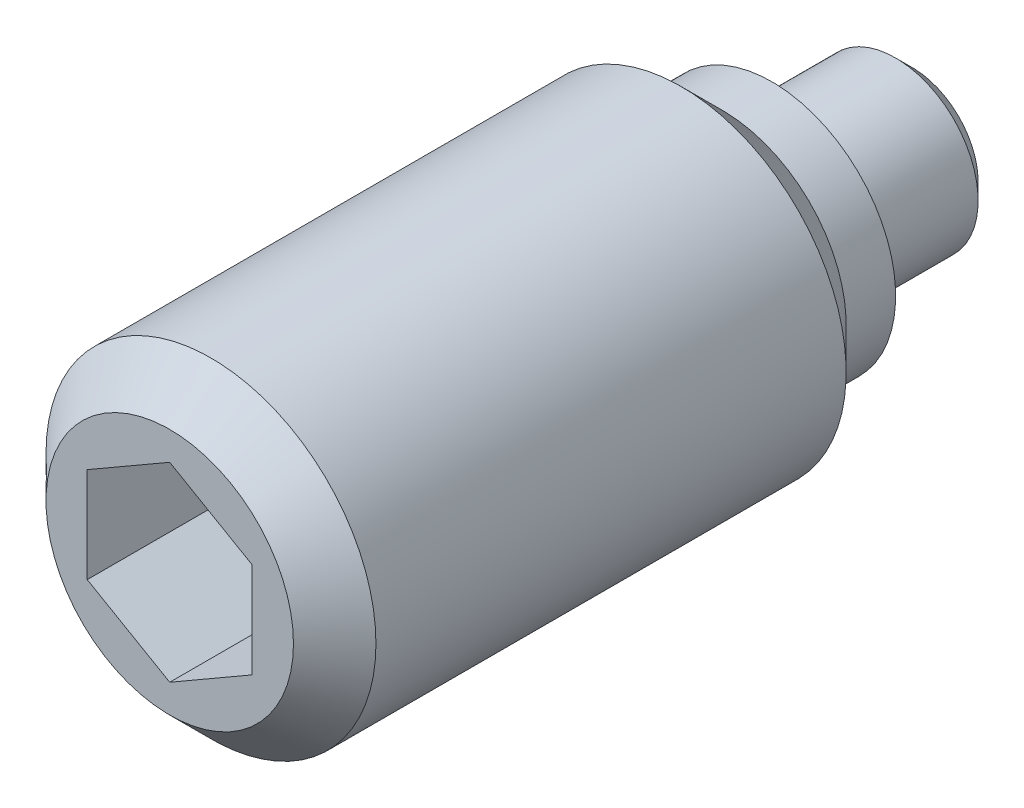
ISO-10303-21;
HEADER;
FILE_DESCRIPTION(('STEP AP214'),'2;1');
FILE_NAME('part.step','',(''),(''),'','','');
FILE_SCHEMA(('AUTOMOTIVE_DESIGN { 1 0 10303 214 1 1 1 1 }'));
ENDSEC;
DATA;
#1=APPLICATION_CONTEXT('core data for automotive mechanical design processes');
#2=APPLICATION_PROTOCOL_DEFINITION('international standard','automotive_design',2000,#1);
#3=PRODUCT_CONTEXT('',#1,'mechanical');
#4=PRODUCT('Part','Part','',(#3));
#5=PRODUCT_RELATED_PRODUCT_CATEGORY('part','',(#4));
#6=PRODUCT_DEFINITION_FORMATION('','',#4);
#7=PRODUCT_DEFINITION_CONTEXT('part definition',#1,'design');
#8=PRODUCT_DEFINITION('design','',#6,#7);
#9=PRODUCT_DEFINITION_SHAPE('','',#8);
#10=(LENGTH_UNIT() NAMED_UNIT(*) SI_UNIT(.MILLI.,.METRE.));
#11=(NAMED_UNIT(*) PLANE_ANGLE_UNIT() SI_UNIT($,.RADIAN.));
#12=(NAMED_UNIT(*) SI_UNIT($,.STERADIAN.) SOLID_ANGLE_UNIT());
#13=UNCERTAINTY_MEASURE_WITH_UNIT(LENGTH_MEASURE(1.E-05),#10,'distance_accuracy_value','');
#14=(GEOMETRIC_REPRESENTATION_CONTEXT(3) GLOBAL_UNCERTAINTY_ASSIGNED_CONTEXT((#13)) GLOBAL_UNIT_ASSIGNED_CONTEXT((#10,
#11,#12)) REPRESENTATION_CONTEXT('',''));
#15=CARTESIAN_POINT('',(0.,0.,0.));
#16=DIRECTION('',(0.,0.,1.));
#17=DIRECTION('',(1.,0.,0.));
#18=AXIS2_PLACEMENT_3D('',#15,#16,#17);
#19=CARTESIAN_POINT('',(0.,0.,0.));
#20=DIRECTION('',(0.,0.,-1.));
#21=DIRECTION('',(-1.,0.,0.));
#22=AXIS2_PLACEMENT_3D('',#19,#20,#21);
#23=CYLINDRICAL_SURFACE('',#22,1.);
#24=CARTESIAN_POINT('',(0.,0.,0.2));
#25=DIRECTION('',(0.,0.,-1.));
#26=DIRECTION('',(-1.,0.,0.));
#27=AXIS2_PLACEMENT_3D('',#24,#25,#26);
#28=CIRCLE('',#27,1.);
#29=CARTESIAN_POINT('',(-1.,0.,0.2));
#30=VERTEX_POINT('',#29);
#31=EDGE_CURVE('E133',#30,#30,#28,.T.);
#32=ORIENTED_EDGE('',*,*,#31,.F.);
#33=EDGE_LOOP('',(#32));
#34=FACE_BOUND('',#33,.T.);
#35=CARTESIAN_POINT('',(0.,0.,1.7));
#36=DIRECTION('',(0.,0.,-1.));
#37=DIRECTION('',(-1.,0.,0.));
#38=AXIS2_PLACEMENT_3D('',#35,#36,#37);
#39=CIRCLE('',#38,1.);
#40=CARTESIAN_POINT('',(-1.,0.,1.7));
#41=VERTEX_POINT('',#40);
#42=EDGE_CURVE('E127',#41,#41,#39,.T.);
#43=ORIENTED_EDGE('',*,*,#42,.T.);
#44=EDGE_LOOP('',(#43));
#45=FACE_BOUND('',#44,.T.);
#46=ADVANCED_FACE('F14',(#34,#45),#23,.T.);
#47=CARTESIAN_POINT('',(0.,0.,0.2));
#48=DIRECTION('',(0.,0.,1.));
#49=DIRECTION('',(1.,0.,0.));
#50=AXIS2_PLACEMENT_3D('',#47,#48,#49);
#51=CONICAL_SURFACE('',#50,1.,0.785398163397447);
#52=CARTESIAN_POINT('',(0.,0.,0.));
#53=DIRECTION('',(0.,0.,-1.));
#54=DIRECTION('',(-1.,0.,0.));
#55=AXIS2_PLACEMENT_3D('',#52,#53,#54);
#56=CIRCLE('',#55,0.8);
#57=CARTESIAN_POINT('',(-0.8,0.,0.));
#58=VERTEX_POINT('',#57);
#59=EDGE_CURVE('E130',#58,#58,#56,.T.);
#60=ORIENTED_EDGE('',*,*,#59,.F.);
#61=EDGE_LOOP('',(#60));
#62=FACE_BOUND('',#61,.T.);
#63=ORIENTED_EDGE('',*,*,#31,.T.);
#64=EDGE_LOOP('',(#63));
#65=FACE_BOUND('',#64,.T.);
#66=ADVANCED_FACE('F157',(#62,#65),#51,.T.);
#67=CARTESIAN_POINT('',(0.,0.8,0.));
#68=DIRECTION('',(0.,0.,1.));
#69=DIRECTION('',(1.,0.,0.));
#70=AXIS2_PLACEMENT_3D('',#67,#68,#69);
#71=PLANE('',#70);
#72=ORIENTED_EDGE('',*,*,#59,.T.);
#73=EDGE_LOOP('',(#72));
#74=FACE_BOUND('',#73,.T.);
#75=ADVANCED_FACE('F154',(#74),#71,.F.);
#76=CARTESIAN_POINT('',(0.,0.,1.7));
#77=DIRECTION('',(0.,0.,-1.));
#78=DIRECTION('',(-1.,0.,0.));
#79=AXIS2_PLACEMENT_3D('',#76,#77,#78);
#80=CYLINDRICAL_SURFACE('',#79,2.);
#81=CARTESIAN_POINT('',(0.,0.,2.8));
#82=DIRECTION('',(0.,0.,-1.));
#83=DIRECTION('',(-1.,0.,0.));
#84=AXIS2_PLACEMENT_3D('',#81,#82,#83);
#85=CIRCLE('',#84,2.);
#86=CARTESIAN_POINT('',(-2.,0.,2.8));
#87=VERTEX_POINT('',#86);
#88=EDGE_CURVE('E9',#87,#87,#85,.T.);
#89=ORIENTED_EDGE('',*,*,#88,.F.);
#90=EDGE_LOOP('',(#89));
#91=FACE_BOUND('',#90,.T.);
#92=CARTESIAN_POINT('',(0.,0.,8.5));
#93=DIRECTION('',(0.,0.,1.));
#94=DIRECTION('',(1.,0.,0.));
#95=AXIS2_PLACEMENT_3D('',#92,#93,#94);
#96=CIRCLE('',#95,2.);
#97=CARTESIAN_POINT('',(2.,0.,8.5));
#98=VERTEX_POINT('',#97);
#99=EDGE_CURVE('E124',#98,#98,#96,.T.);
#100=ORIENTED_EDGE('',*,*,#99,.F.);
#101=EDGE_LOOP('',(#100));
#102=FACE_BOUND('',#101,.T.);
#103=ADVANCED_FACE('F16',(#91,#102),#80,.T.);
#104=CARTESIAN_POINT('',(0.,0.,2.8));
#105=DIRECTION('',(0.,0.,1.));
#106=DIRECTION('',(1.,0.,0.));
#107=AXIS2_PLACEMENT_3D('',#104,#105,#106);
#108=CONICAL_SURFACE('',#107,2.,0.785398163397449);
#109=ORIENTED_EDGE('',*,*,#88,.T.);
#110=EDGE_LOOP('',(#109));
#111=FACE_BOUND('',#110,.T.);
#112=CARTESIAN_POINT('',(0.,0.,2.3));
#113=DIRECTION('',(0.,0.,-1.));
#114=DIRECTION('',(-1.,0.,0.));
#115=AXIS2_PLACEMENT_3D('',#112,#113,#114);
#116=CIRCLE('',#115,1.5);
#117=CARTESIAN_POINT('',(-1.5,0.,2.3));
#118=VERTEX_POINT('',#117);
#119=EDGE_CURVE('E22',#118,#118,#116,.T.);
#120=ORIENTED_EDGE('',*,*,#119,.F.);
#121=EDGE_LOOP('',(#120));
#122=FACE_BOUND('',#121,.T.);
#123=ADVANCED_FACE('F143',(#111,#122),#108,.T.);
#124=CARTESIAN_POINT('',(0.,0.,1.7));
#125=DIRECTION('',(0.,0.,-1.));
#126=DIRECTION('',(-1.,0.,0.));
#127=AXIS2_PLACEMENT_3D('',#124,#125,#126);
#128=CYLINDRICAL_SURFACE('',#127,1.5);
#129=CARTESIAN_POINT('',(0.,0.,1.7));
#130=DIRECTION('',(0.,0.,-1.));
#131=DIRECTION('',(-1.,0.,0.));
#132=AXIS2_PLACEMENT_3D('',#129,#130,#131);
#133=CIRCLE('',#132,1.5);
#134=CARTESIAN_POINT('',(-1.5,0.,1.7));
#135=VERTEX_POINT('',#134);
#136=EDGE_CURVE('E136',#135,#135,#133,.T.);
#137=ORIENTED_EDGE('',*,*,#136,.F.);
#138=EDGE_LOOP('',(#137));
#139=FACE_BOUND('',#138,.T.);
#140=ORIENTED_EDGE('',*,*,#119,.T.);
#141=EDGE_LOOP('',(#140));
#142=FACE_BOUND('',#141,.T.);
#143=ADVANCED_FACE('F141',(#139,#142),#128,.T.);
#144=CARTESIAN_POINT('',(0.,1.5,1.7));
#145=DIRECTION('',(0.,0.,1.));
#146=DIRECTION('',(1.,0.,0.));
#147=AXIS2_PLACEMENT_3D('',#144,#145,#146);
#148=PLANE('',#147);
#149=ORIENTED_EDGE('',*,*,#136,.T.);
#150=EDGE_LOOP('',(#149));
#151=FACE_BOUND('',#150,.T.);
#152=ORIENTED_EDGE('',*,*,#42,.F.);
#153=EDGE_LOOP('',(#152));
#154=FACE_BOUND('',#153,.T.);
#155=ADVANCED_FACE('F151',(#151,#154),#148,.F.);
#156=CARTESIAN_POINT('',(0.,-1.5,9.));
#157=DIRECTION('',(0.,0.,1.));
#158=DIRECTION('',(1.,0.,0.));
#159=AXIS2_PLACEMENT_3D('',#156,#157,#158);
#160=PLANE('',#159);
#161=DIRECTION('',(0.866025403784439,-0.5,0.));
#162=VECTOR('',#161,1.);
#163=CARTESIAN_POINT('',(-1.,-0.577350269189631,9.));
#164=LINE('',#163,#162);
#165=CARTESIAN_POINT('',(-1.,-0.577350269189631,9.));
#166=VERTEX_POINT('',#165);
#167=CARTESIAN_POINT('',(0.,-1.15470053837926,9.));
#168=VERTEX_POINT('',#167);
#169=EDGE_CURVE('E29',#166,#168,#164,.T.);
#170=ORIENTED_EDGE('',*,*,#169,.F.);
#171=DIRECTION('',(0.,-1.,0.));
#172=VECTOR('',#171,1.);
#173=CARTESIAN_POINT('',(-1.,0.577350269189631,9.));
#174=LINE('',#173,#172);
#175=CARTESIAN_POINT('',(-1.,0.577350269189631,9.));
#176=VERTEX_POINT('',#175);
#177=EDGE_CURVE('E112',#176,#166,#174,.T.);
#178=ORIENTED_EDGE('',*,*,#177,.F.);
#179=DIRECTION('',(-0.866025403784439,-0.5,0.));
#180=VECTOR('',#179,1.);
#181=CARTESIAN_POINT('',(0.,1.15470053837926,9.));
#182=LINE('',#181,#180);
#183=CARTESIAN_POINT('',(0.,1.15470053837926,9.));
#184=VERTEX_POINT('',#183);
#185=EDGE_CURVE('E110',#184,#176,#182,.T.);
#186=ORIENTED_EDGE('',*,*,#185,.F.);
#187=DIRECTION('',(-0.866025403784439,0.5,0.));
#188=VECTOR('',#187,1.);
#189=CARTESIAN_POINT('',(1.,0.577350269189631,9.));
#190=LINE('',#189,#188);
#191=CARTESIAN_POINT('',(1.,0.577350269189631,9.));
#192=VERTEX_POINT('',#191);
#193=EDGE_CURVE('E77',#192,#184,#190,.T.);
#194=ORIENTED_EDGE('',*,*,#193,.F.);
#195=DIRECTION('',(0.,1.,0.));
#196=VECTOR('',#195,1.);
#197=CARTESIAN_POINT('',(1.,-0.577350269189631,9.));
#198=LINE('',#197,#196);
#199=CARTESIAN_POINT('',(1.,-0.577350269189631,9.));
#200=VERTEX_POINT('',#199);
#201=EDGE_CURVE('E106',#200,#192,#198,.T.);
#202=ORIENTED_EDGE('',*,*,#201,.F.);
#203=DIRECTION('',(0.866025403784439,0.5,0.));
#204=VECTOR('',#203,1.);
#205=CARTESIAN_POINT('',(0.,-1.15470053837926,9.));
#206=LINE('',#205,#204);
#207=EDGE_CURVE('E103',#168,#200,#206,.T.);
#208=ORIENTED_EDGE('',*,*,#207,.F.);
#209=EDGE_LOOP('',(#170,#178,#186,#194,#202,#208));
#210=FACE_BOUND('',#209,.T.);
#211=CARTESIAN_POINT('',(0.,0.,9.));
#212=DIRECTION('',(0.,0.,1.));
#213=DIRECTION('',(1.,0.,0.));
#214=AXIS2_PLACEMENT_3D('',#211,#212,#213);
#215=CIRCLE('',#214,1.5);
#216=CARTESIAN_POINT('',(1.5,0.,9.));
#217=VERTEX_POINT('',#216);
#218=EDGE_CURVE('E116',#217,#217,#215,.T.);
#219=ORIENTED_EDGE('',*,*,#218,.T.);
#220=EDGE_LOOP('',(#219));
#221=FACE_BOUND('',#220,.T.);
#222=ADVANCED_FACE('F170',(#210,#221),#160,.T.);
#223=CARTESIAN_POINT('',(0.,0.,9.));
#224=DIRECTION('',(0.,0.,-1.));
#225=DIRECTION('',(-1.,0.,0.));
#226=AXIS2_PLACEMENT_3D('',#223,#224,#225);
#227=CONICAL_SURFACE('',#226,1.5,0.785398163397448);
#228=ORIENTED_EDGE('',*,*,#99,.T.);
#229=EDGE_LOOP('',(#228));
#230=FACE_BOUND('',#229,.T.);
#231=ORIENTED_EDGE('',*,*,#218,.F.);
#232=EDGE_LOOP('',(#231));
#233=FACE_BOUND('',#232,.T.);
#234=ADVANCED_FACE('F175',(#230,#233),#227,.T.);
#235=CARTESIAN_POINT('',(-1.,-0.577350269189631,6.5));
#236=DIRECTION('',(-0.5,-0.866025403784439,0.));
#237=DIRECTION('',(0.866025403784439,-0.5,0.));
#238=AXIS2_PLACEMENT_3D('',#235,#236,#237);
#239=PLANE('',#238);
#240=ORIENTED_EDGE('',*,*,#169,.T.);
#241=DIRECTION('',(0.,0.,1.));
#242=VECTOR('',#241,1.);
#243=CARTESIAN_POINT('',(0.,-1.15470053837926,6.5));
#244=LINE('',#243,#242);
#245=CARTESIAN_POINT('',(0.,-1.15470053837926,6.5));
#246=VERTEX_POINT('',#245);
#247=EDGE_CURVE('E59',#246,#168,#244,.T.);
#248=ORIENTED_EDGE('',*,*,#247,.F.);
#249=DIRECTION('',(0.866025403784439,-0.5,0.));
#250=VECTOR('',#249,1.);
#251=CARTESIAN_POINT('',(-1.,-0.577350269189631,6.5));
#252=LINE('',#251,#250);
#253=CARTESIAN_POINT('',(-1.,-0.577350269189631,6.5));
#254=VERTEX_POINT('',#253);
#255=EDGE_CURVE('E114',#254,#246,#252,.T.);
#256=ORIENTED_EDGE('',*,*,#255,.F.);
#257=DIRECTION('',(0.,0.,1.));
#258=VECTOR('',#257,1.);
#259=CARTESIAN_POINT('',(-1.,-0.577350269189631,6.5));
#260=LINE('',#259,#258);
#261=EDGE_CURVE('E37',#254,#166,#260,.T.);
#262=ORIENTED_EDGE('',*,*,#261,.T.);
#263=EDGE_LOOP('',(#240,#248,#256,#262));
#264=FACE_BOUND('',#263,.T.);
#265=ADVANCED_FACE('F184',(#264),#239,.F.);
#266=CARTESIAN_POINT('',(-1.,0.577350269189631,6.5));
#267=DIRECTION('',(-1.,0.,0.));
#268=DIRECTION('',(0.,0.,1.));
#269=AXIS2_PLACEMENT_3D('',#266,#267,#268);
#270=PLANE('',#269);
#271=ORIENTED_EDGE('',*,*,#177,.T.);
#272=ORIENTED_EDGE('',*,*,#261,.F.);
#273=DIRECTION('',(0.,-1.,0.));
#274=VECTOR('',#273,1.);
#275=CARTESIAN_POINT('',(-1.,0.577350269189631,6.5));
#276=LINE('',#275,#274);
#277=CARTESIAN_POINT('',(-1.,0.577350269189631,6.5));
#278=VERTEX_POINT('',#277);
#279=EDGE_CURVE('E89',#278,#254,#276,.T.);
#280=ORIENTED_EDGE('',*,*,#279,.F.);
#281=DIRECTION('',(0.,0.,1.));
#282=VECTOR('',#281,1.);
#283=CARTESIAN_POINT('',(-1.,0.577350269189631,6.5));
#284=LINE('',#283,#282);
#285=EDGE_CURVE('E81',#278,#176,#284,.T.);
#286=ORIENTED_EDGE('',*,*,#285,.T.);
#287=EDGE_LOOP('',(#271,#272,#280,#286));
#288=FACE_BOUND('',#287,.T.);
#289=ADVANCED_FACE('F244',(#288),#270,.F.);
#290=CARTESIAN_POINT('',(0.,1.15470053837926,6.5));
#291=DIRECTION('',(-0.5,0.866025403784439,0.));
#292=DIRECTION('',(-0.866025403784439,-0.5,0.));
#293=AXIS2_PLACEMENT_3D('',#290,#291,#292);
#294=PLANE('',#293);
#295=ORIENTED_EDGE('',*,*,#185,.T.);
#296=ORIENTED_EDGE('',*,*,#285,.F.);
#297=DIRECTION('',(-0.866025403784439,-0.5,0.));
#298=VECTOR('',#297,1.);
#299=CARTESIAN_POINT('',(0.,1.15470053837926,6.5));
#300=LINE('',#299,#298);
#301=CARTESIAN_POINT('',(0.,1.15470053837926,6.5));
#302=VERTEX_POINT('',#301);
#303=EDGE_CURVE('E85',#302,#278,#300,.T.);
#304=ORIENTED_EDGE('',*,*,#303,.F.);
#305=DIRECTION('',(0.,0.,1.));
#306=VECTOR('',#305,1.);
#307=CARTESIAN_POINT('',(0.,1.15470053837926,6.5));
#308=LINE('',#307,#306);
#309=EDGE_CURVE('E70',#302,#184,#308,.T.);
#310=ORIENTED_EDGE('',*,*,#309,.T.);
#311=EDGE_LOOP('',(#295,#296,#304,#310));
#312=FACE_BOUND('',#311,.T.);
#313=ADVANCED_FACE('F86',(#312),#294,.F.);
#314=CARTESIAN_POINT('',(1.,0.577350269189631,6.5));
#315=DIRECTION('',(0.5,0.866025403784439,0.));
#316=DIRECTION('',(-0.866025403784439,0.5,0.));
#317=AXIS2_PLACEMENT_3D('',#314,#315,#316);
#318=PLANE('',#317);
#319=ORIENTED_EDGE('',*,*,#193,.T.);
#320=ORIENTED_EDGE('',*,*,#309,.F.);
#321=DIRECTION('',(-0.866025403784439,0.5,0.));
#322=VECTOR('',#321,1.);
#323=CARTESIAN_POINT('',(1.,0.577350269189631,6.5));
#324=LINE('',#323,#322);
#325=CARTESIAN_POINT('',(1.,0.577350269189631,6.5));
#326=VERTEX_POINT('',#325);
#327=EDGE_CURVE('E74',#326,#302,#324,.T.);
#328=ORIENTED_EDGE('',*,*,#327,.F.);
#329=DIRECTION('',(0.,0.,1.));
#330=VECTOR('',#329,1.);
#331=CARTESIAN_POINT('',(1.,0.577350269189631,6.5));
#332=LINE('',#331,#330);
#333=EDGE_CURVE('E82',#326,#192,#332,.T.);
#334=ORIENTED_EDGE('',*,*,#333,.T.);
#335=EDGE_LOOP('',(#319,#320,#328,#334));
#336=FACE_BOUND('',#335,.T.);
#337=ADVANCED_FACE('F72',(#336),#318,.F.);
#338=CARTESIAN_POINT('',(1.,-0.577350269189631,6.5));
#339=DIRECTION('',(1.,0.,0.));
#340=DIRECTION('',(0.,0.,-1.));
#341=AXIS2_PLACEMENT_3D('',#338,#339,#340);
#342=PLANE('',#341);
#343=ORIENTED_EDGE('',*,*,#201,.T.);
#344=ORIENTED_EDGE('',*,*,#333,.F.);
#345=DIRECTION('',(0.,1.,0.));
#346=VECTOR('',#345,1.);
#347=CARTESIAN_POINT('',(1.,-0.577350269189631,6.5));
#348=LINE('',#347,#346);
#349=CARTESIAN_POINT('',(1.,-0.577350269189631,6.5));
#350=VERTEX_POINT('',#349);
#351=EDGE_CURVE('E95',#350,#326,#348,.T.);
#352=ORIENTED_EDGE('',*,*,#351,.F.);
#353=DIRECTION('',(0.,0.,1.));
#354=VECTOR('',#353,1.);
#355=CARTESIAN_POINT('',(1.,-0.577350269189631,6.5));
#356=LINE('',#355,#354);
#357=EDGE_CURVE('E119',#350,#200,#356,.T.);
#358=ORIENTED_EDGE('',*,*,#357,.T.);
#359=EDGE_LOOP('',(#343,#344,#352,#358));
#360=FACE_BOUND('',#359,.T.);
#361=ADVANCED_FACE('F268',(#360),#342,.F.);
#362=CARTESIAN_POINT('',(0.,-1.15470053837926,6.5));
#363=DIRECTION('',(0.5,-0.866025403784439,0.));
#364=DIRECTION('',(0.866025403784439,0.5,0.));
#365=AXIS2_PLACEMENT_3D('',#362,#363,#364);
#366=PLANE('',#365);
#367=ORIENTED_EDGE('',*,*,#207,.T.);
#368=ORIENTED_EDGE('',*,*,#357,.F.);
#369=DIRECTION('',(0.866025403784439,0.5,0.));
#370=VECTOR('',#369,1.);
#371=CARTESIAN_POINT('',(0.,-1.15470053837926,6.5));
#372=LINE('',#371,#370);
#373=EDGE_CURVE('E97',#246,#350,#372,.T.);
#374=ORIENTED_EDGE('',*,*,#373,.F.);
#375=ORIENTED_EDGE('',*,*,#247,.T.);
#376=EDGE_LOOP('',(#367,#368,#374,#375));
#377=FACE_BOUND('',#376,.T.);
#378=ADVANCED_FACE('F277',(#377),#366,.F.);
#379=CARTESIAN_POINT('',(0.,0.,6.5));
#380=DIRECTION('',(0.,0.,1.));
#381=DIRECTION('',(1.,0.,0.));
#382=AXIS2_PLACEMENT_3D('',#379,#380,#381);
#383=PLANE('',#382);
#384=ORIENTED_EDGE('',*,*,#255,.T.);
#385=ORIENTED_EDGE('',*,*,#373,.T.);
#386=ORIENTED_EDGE('',*,*,#351,.T.);
#387=ORIENTED_EDGE('',*,*,#327,.T.);
#388=ORIENTED_EDGE('',*,*,#303,.T.);
#389=ORIENTED_EDGE('',*,*,#279,.T.);
#390=EDGE_LOOP('',(#384,#385,#386,#387,#388,#389));
#391=FACE_BOUND('',#390,.T.);
#392=ADVANCED_FACE('F92',(#391),#383,.T.);
#393=CLOSED_SHELL('',(#46,#66,#75,#103,#123,#143,#155,#222,#234,#265,#289,#313,#337,#361,#378,#392));
#394=MANIFOLD_SOLID_BREP('B1',#393);
#395=ADVANCED_BREP_SHAPE_REPRESENTATION('',(#18,#394),#14);
#396=SHAPE_DEFINITION_REPRESENTATION(#9,#395);
ENDSEC;
END-ISO-10303-21;
